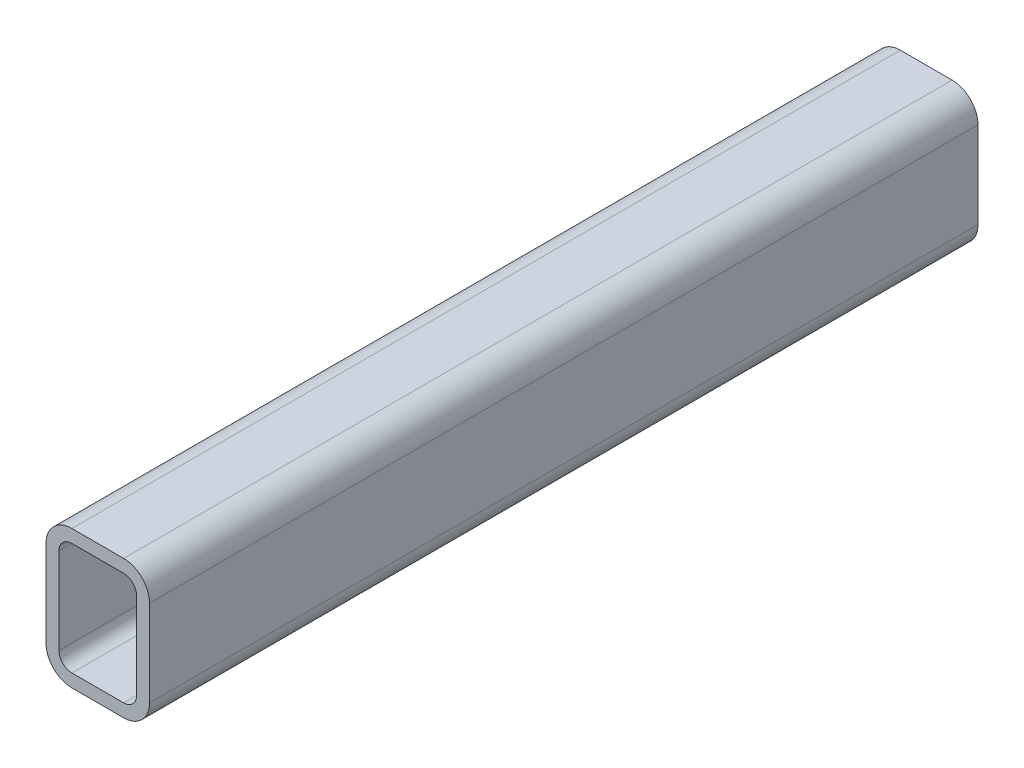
from build123d import *

# Parameters (mm, degrees)
BOSS_EXTRUDE1_DEPTH = 304.8


with BuildPart() as part:
    # Sketch1 → Boss-Extrude1 (new body)
    with BuildSketch(Plane.XY):
        with BuildLine():
            Line((9.525, 50.8), (28.575, 50.8))
            ThreePointArc((28.575, 50.8), (35.310192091, 48.010192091), (38.1, 41.275))
            Line((38.1, 41.275), (38.1, 9.525))
            ThreePointArc((38.1, 9.525), (35.310192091, 2.789807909), (28.575, 0))
            Line((28.575, 0), (9.525, 0))
            ThreePointArc((9.525, 0), (2.789807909, 2.789807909), (0, 9.525))
            Line((0, 9.525), (0, 41.275))
            ThreePointArc((0, 41.275), (2.789807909, 48.010192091), (9.525, 50.8))
        make_face()
        with BuildLine():
            Line((9.525, 46.0375), (28.575, 46.0375))
            ThreePointArc((28.575, 46.0375), (31.942596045, 44.642596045), (33.3375, 41.275))
            Line((33.3375, 41.275), (33.3375, 9.525))
            ThreePointArc((33.3375, 9.525), (31.942596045, 6.157403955), (28.575, 4.7625))
            Line((28.575, 4.7625), (9.525, 4.7625))
            ThreePointArc((9.525, 4.7625), (6.157403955, 6.157403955), (4.7625, 9.525))
            Line((4.7625, 9.525), (4.7625, 41.275))
            ThreePointArc((4.7625, 41.275), (6.157403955, 44.642596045), (9.525, 46.0375))
        make_face(mode=Mode.SUBTRACT)
    extrude(amount=BOSS_EXTRUDE1_DEPTH)


solid = part.part
